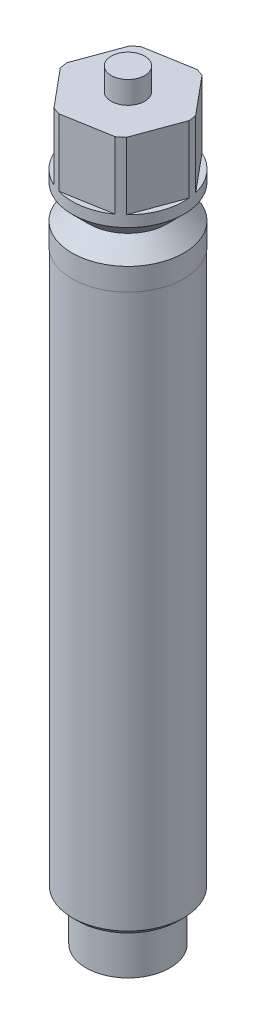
ISO-10303-21;
HEADER;
FILE_DESCRIPTION(('STEP AP214'),'2;1');
FILE_NAME('part.step','',(''),(''),'','','');
FILE_SCHEMA(('AUTOMOTIVE_DESIGN { 1 0 10303 214 1 1 1 1 }'));
ENDSEC;
DATA;
#1=APPLICATION_CONTEXT('core data for automotive mechanical design processes');
#2=APPLICATION_PROTOCOL_DEFINITION('international standard','automotive_design',2000,#1);
#3=PRODUCT_CONTEXT('',#1,'mechanical');
#4=PRODUCT('Part','Part','',(#3));
#5=PRODUCT_RELATED_PRODUCT_CATEGORY('part','',(#4));
#6=PRODUCT_DEFINITION_FORMATION('','',#4);
#7=PRODUCT_DEFINITION_CONTEXT('part definition',#1,'design');
#8=PRODUCT_DEFINITION('design','',#6,#7);
#9=PRODUCT_DEFINITION_SHAPE('','',#8);
#10=(LENGTH_UNIT() NAMED_UNIT(*) SI_UNIT(.MILLI.,.METRE.));
#11=(NAMED_UNIT(*) PLANE_ANGLE_UNIT() SI_UNIT($,.RADIAN.));
#12=(NAMED_UNIT(*) SI_UNIT($,.STERADIAN.) SOLID_ANGLE_UNIT());
#13=UNCERTAINTY_MEASURE_WITH_UNIT(LENGTH_MEASURE(1.E-05),#10,'distance_accuracy_value','');
#14=(GEOMETRIC_REPRESENTATION_CONTEXT(3) GLOBAL_UNCERTAINTY_ASSIGNED_CONTEXT((#13)) GLOBAL_UNIT_ASSIGNED_CONTEXT((#10,
#11,#12)) REPRESENTATION_CONTEXT('',''));
#15=CARTESIAN_POINT('',(0.,0.,0.));
#16=DIRECTION('',(0.,0.,1.));
#17=DIRECTION('',(1.,0.,0.));
#18=AXIS2_PLACEMENT_3D('',#15,#16,#17);
#19=CARTESIAN_POINT('',(0.,-50.,0.));
#20=DIRECTION('',(0.,-1.,0.));
#21=DIRECTION('',(0.,0.,-1.));
#22=AXIS2_PLACEMENT_3D('',#19,#20,#21);
#23=PLANE('',#22);
#24=CARTESIAN_POINT('',(0.,-50.,0.));
#25=DIRECTION('',(0.,-1.,0.));
#26=DIRECTION('',(0.,0.,-1.));
#27=AXIS2_PLACEMENT_3D('',#24,#25,#26);
#28=CIRCLE('',#27,4.48);
#29=CARTESIAN_POINT('',(0.,-50.,-4.48));
#30=VERTEX_POINT('',#29);
#31=EDGE_CURVE('E356',#30,#30,#28,.T.);
#32=ORIENTED_EDGE('',*,*,#31,.T.);
#33=EDGE_LOOP('',(#32));
#34=FACE_BOUND('',#33,.T.);
#35=CARTESIAN_POINT('',(0.,-50.,0.));
#36=DIRECTION('',(0.,-1.,0.));
#37=DIRECTION('',(0.,0.,-1.));
#38=AXIS2_PLACEMENT_3D('',#35,#36,#37);
#39=CIRCLE('',#38,3.75);
#40=CARTESIAN_POINT('',(0.,-50.,-3.75));
#41=VERTEX_POINT('',#40);
#42=EDGE_CURVE('E626',#41,#41,#39,.T.);
#43=ORIENTED_EDGE('',*,*,#42,.F.);
#44=EDGE_LOOP('',(#43));
#45=FACE_BOUND('',#44,.T.);
#46=ADVANCED_FACE('F348',(#34,#45),#23,.T.);
#47=CARTESIAN_POINT('',(0.,0.,0.));
#48=DIRECTION('',(0.,1.,0.));
#49=DIRECTION('',(0.,0.,1.));
#50=AXIS2_PLACEMENT_3D('',#47,#48,#49);
#51=PLANE('',#50);
#52=CARTESIAN_POINT('',(0.,0.,0.));
#53=DIRECTION('',(0.,1.,0.));
#54=DIRECTION('',(0.,0.,1.));
#55=AXIS2_PLACEMENT_3D('',#52,#53,#54);
#56=CIRCLE('',#55,5.);
#57=CARTESIAN_POINT('',(0.,0.,5.));
#58=VERTEX_POINT('',#57);
#59=EDGE_CURVE('E472',#58,#58,#56,.T.);
#60=ORIENTED_EDGE('',*,*,#59,.F.);
#61=EDGE_LOOP('',(#60));
#62=FACE_BOUND('',#61,.T.);
#63=CARTESIAN_POINT('',(0.,0.,0.));
#64=DIRECTION('',(0.,1.,0.));
#65=DIRECTION('',(0.,0.,1.));
#66=AXIS2_PLACEMENT_3D('',#63,#64,#65);
#67=CIRCLE('',#66,4.98);
#68=CARTESIAN_POINT('',(0.,0.,4.98));
#69=VERTEX_POINT('',#68);
#70=EDGE_CURVE('E500',#69,#69,#67,.F.);
#71=ORIENTED_EDGE('',*,*,#70,.F.);
#72=EDGE_LOOP('',(#71));
#73=FACE_BOUND('',#72,.T.);
#74=ADVANCED_FACE('F521',(#62,#73),#51,.F.);
#75=CARTESIAN_POINT('',(0.,12.,0.));
#76=DIRECTION('',(0.,1.,0.));
#77=DIRECTION('',(0.,0.,1.));
#78=AXIS2_PLACEMENT_3D('',#75,#76,#77);
#79=PLANE('',#78);
#80=CARTESIAN_POINT('',(0.,12.,0.));
#81=DIRECTION('',(0.,1.,0.));
#82=DIRECTION('',(0.,0.,1.));
#83=AXIS2_PLACEMENT_3D('',#80,#81,#82);
#84=CIRCLE('',#83,1.5);
#85=CARTESIAN_POINT('',(0.,12.,1.5));
#86=VERTEX_POINT('',#85);
#87=EDGE_CURVE('E586',#86,#86,#84,.T.);
#88=ORIENTED_EDGE('',*,*,#87,.F.);
#89=EDGE_LOOP('',(#88));
#90=FACE_BOUND('',#89,.T.);
#91=CARTESIAN_POINT('',(0.,12.,0.));
#92=DIRECTION('',(0.,1.,0.));
#93=DIRECTION('',(0.,0.,1.));
#94=AXIS2_PLACEMENT_3D('',#91,#92,#93);
#95=CIRCLE('',#94,5.);
#96=CARTESIAN_POINT('',(2.06183256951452,12.,-4.5550901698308));
#97=VERTEX_POINT('',#96);
#98=CARTESIAN_POINT('',(1.38132784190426,12.,-4.80540668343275));
#99=VERTEX_POINT('',#98);
#100=EDGE_CURVE('E463',#97,#99,#95,.T.);
#101=ORIENTED_EDGE('',*,*,#100,.T.);
#102=DIRECTION('',(-0.985394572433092,0.,0.170286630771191));
#103=VECTOR('',#102,1.);
#104=CARTESIAN_POINT('',(1.79384035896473,12.,-4.87669322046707));
#105=LINE('',#104,#103);
#106=CARTESIAN_POINT('',(-2.91390751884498,12.,-4.06314446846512));
#107=VERTEX_POINT('',#106);
#108=EDGE_CURVE('E448',#99,#107,#105,.T.);
#109=ORIENTED_EDGE('',*,*,#108,.T.);
#110=CARTESIAN_POINT('',(-3.47094034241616,12.,-3.5989683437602));
#111=VERTEX_POINT('',#110);
#112=EDGE_CURVE('E455',#107,#111,#95,.T.);
#113=ORIENTED_EDGE('',*,*,#112,.T.);
#114=DIRECTION('',(-0.345224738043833,0.,0.938520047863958));
#115=VECTOR('',#114,1.);
#116=CARTESIAN_POINT('',(-3.32642003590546,12.,-3.99185793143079));
#117=LINE('',#116,#115);
#118=CARTESIAN_POINT('',(-4.9757400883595,12.,0.491945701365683));
#119=VERTEX_POINT('',#118);
#120=EDGE_CURVE('E436',#111,#119,#117,.T.);
#121=ORIENTED_EDGE('',*,*,#120,.T.);
#122=CARTESIAN_POINT('',(-4.85226818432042,12.,1.20643833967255));
#123=VERTEX_POINT('',#122);
#124=EDGE_CURVE('E464',#119,#123,#95,.T.);
#125=ORIENTED_EDGE('',*,*,#124,.T.);
#126=DIRECTION('',(0.640169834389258,0.,0.768233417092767));
#127=VECTOR('',#126,1.);
#128=CARTESIAN_POINT('',(-5.1202603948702,12.,0.884835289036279));
#129=LINE('',#128,#127);
#130=CARTESIAN_POINT('',(-2.06183256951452,12.,4.5550901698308));
#131=VERTEX_POINT('',#130);
#132=EDGE_CURVE('E447',#123,#131,#129,.T.);
#133=ORIENTED_EDGE('',*,*,#132,.T.);
#134=CARTESIAN_POINT('',(-1.38132784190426,12.,4.80540668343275));
#135=VERTEX_POINT('',#134);
#136=EDGE_CURVE('E467',#131,#135,#95,.T.);
#137=ORIENTED_EDGE('',*,*,#136,.T.);
#138=DIRECTION('',(0.985394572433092,0.,-0.170286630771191));
#139=VECTOR('',#138,1.);
#140=CARTESIAN_POINT('',(-1.79384035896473,12.,4.87669322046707));
#141=LINE('',#140,#139);
#142=CARTESIAN_POINT('',(2.91390751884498,12.,4.06314446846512));
#143=VERTEX_POINT('',#142);
#144=EDGE_CURVE('E608',#135,#143,#141,.T.);
#145=ORIENTED_EDGE('',*,*,#144,.T.);
#146=CARTESIAN_POINT('',(3.47094034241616,12.,3.5989683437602));
#147=VERTEX_POINT('',#146);
#148=EDGE_CURVE('E468',#143,#147,#95,.T.);
#149=ORIENTED_EDGE('',*,*,#148,.T.);
#150=DIRECTION('',(0.345224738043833,0.,-0.938520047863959));
#151=VECTOR('',#150,1.);
#152=CARTESIAN_POINT('',(3.32642003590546,12.,3.99185793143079));
#153=LINE('',#152,#151);
#154=CARTESIAN_POINT('',(4.9757400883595,12.,-0.491945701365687));
#155=VERTEX_POINT('',#154);
#156=EDGE_CURVE('E605',#147,#155,#153,.T.);
#157=ORIENTED_EDGE('',*,*,#156,.T.);
#158=CARTESIAN_POINT('',(4.85226818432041,12.,-1.20643833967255));
#159=VERTEX_POINT('',#158);
#160=EDGE_CURVE('E466',#155,#159,#95,.T.);
#161=ORIENTED_EDGE('',*,*,#160,.T.);
#162=DIRECTION('',(-0.640169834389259,0.,-0.768233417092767));
#163=VECTOR('',#162,1.);
#164=CARTESIAN_POINT('',(5.1202603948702,12.,-0.88483528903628));
#165=LINE('',#164,#163);
#166=EDGE_CURVE('E602',#159,#97,#165,.T.);
#167=ORIENTED_EDGE('',*,*,#166,.T.);
#168=EDGE_LOOP('',(#101,#109,#113,#121,#125,#133,#137,#145,#149,#157,#161,#167));
#169=FACE_BOUND('',#168,.T.);
#170=ADVANCED_FACE('F462',(#90,#169),#79,.T.);
#171=CARTESIAN_POINT('',(0.,12.,0.));
#172=DIRECTION('',(0.,-1.,0.));
#173=DIRECTION('',(0.,0.,-1.));
#174=AXIS2_PLACEMENT_3D('',#171,#172,#173);
#175=CYLINDRICAL_SURFACE('',#174,5.);
#176=CARTESIAN_POINT('',(0.,5.,0.));
#177=DIRECTION('',(0.,1.,0.));
#178=DIRECTION('',(0.,0.,1.));
#179=AXIS2_PLACEMENT_3D('',#176,#177,#178);
#180=CIRCLE('',#179,5.);
#181=CARTESIAN_POINT('',(0.,5.,5.));
#182=VERTEX_POINT('',#181);
#183=EDGE_CURVE('E617',#182,#182,#180,.T.);
#184=ORIENTED_EDGE('',*,*,#183,.T.);
#185=EDGE_LOOP('',(#184));
#186=FACE_BOUND('',#185,.T.);
#187=DIRECTION('',(0.,-1.,0.));
#188=VECTOR('',#187,1.);
#189=CARTESIAN_POINT('',(1.38132784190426,12.,-4.80540668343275));
#190=LINE('',#189,#188);
#191=CARTESIAN_POINT('',(1.38132784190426,6.,-4.80540668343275));
#192=VERTEX_POINT('',#191);
#193=EDGE_CURVE('E498',#99,#192,#190,.T.);
#194=ORIENTED_EDGE('',*,*,#193,.F.);
#195=ORIENTED_EDGE('',*,*,#100,.F.);
#196=DIRECTION('',(0.,-1.,0.));
#197=VECTOR('',#196,1.);
#198=CARTESIAN_POINT('',(2.06183256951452,12.,-4.5550901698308));
#199=LINE('',#198,#197);
#200=CARTESIAN_POINT('',(2.06183256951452,6.,-4.5550901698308));
#201=VERTEX_POINT('',#200);
#202=EDGE_CURVE('E491',#201,#97,#199,.F.);
#203=ORIENTED_EDGE('',*,*,#202,.F.);
#204=CARTESIAN_POINT('',(0.,6.,0.));
#205=DIRECTION('',(0.,1.,0.));
#206=DIRECTION('',(0.,0.,1.));
#207=AXIS2_PLACEMENT_3D('',#204,#205,#206);
#208=CIRCLE('',#207,5.);
#209=CARTESIAN_POINT('',(4.85226818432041,6.,-1.20643833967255));
#210=VERTEX_POINT('',#209);
#211=EDGE_CURVE('E493',#210,#201,#208,.T.);
#212=ORIENTED_EDGE('',*,*,#211,.F.);
#213=DIRECTION('',(0.,-1.,0.));
#214=VECTOR('',#213,1.);
#215=CARTESIAN_POINT('',(4.85226818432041,12.,-1.20643833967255));
#216=LINE('',#215,#214);
#217=EDGE_CURVE('E494',#159,#210,#216,.T.);
#218=ORIENTED_EDGE('',*,*,#217,.F.);
#219=ORIENTED_EDGE('',*,*,#160,.F.);
#220=DIRECTION('',(0.,-1.,0.));
#221=VECTOR('',#220,1.);
#222=CARTESIAN_POINT('',(4.9757400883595,12.,-0.491945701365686));
#223=LINE('',#222,#221);
#224=CARTESIAN_POINT('',(4.9757400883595,6.,-0.491945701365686));
#225=VERTEX_POINT('',#224);
#226=EDGE_CURVE('E486',#225,#155,#223,.F.);
#227=ORIENTED_EDGE('',*,*,#226,.F.);
#228=CARTESIAN_POINT('',(3.47094034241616,6.,3.5989683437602));
#229=VERTEX_POINT('',#228);
#230=EDGE_CURVE('E488',#229,#225,#208,.T.);
#231=ORIENTED_EDGE('',*,*,#230,.F.);
#232=DIRECTION('',(0.,-1.,0.));
#233=VECTOR('',#232,1.);
#234=CARTESIAN_POINT('',(3.47094034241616,12.,3.5989683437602));
#235=LINE('',#234,#233);
#236=EDGE_CURVE('E489',#147,#229,#235,.T.);
#237=ORIENTED_EDGE('',*,*,#236,.F.);
#238=ORIENTED_EDGE('',*,*,#148,.F.);
#239=DIRECTION('',(0.,-1.,0.));
#240=VECTOR('',#239,1.);
#241=CARTESIAN_POINT('',(2.91390751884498,12.,4.06314446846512));
#242=LINE('',#241,#240);
#243=CARTESIAN_POINT('',(2.91390751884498,6.,4.06314446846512));
#244=VERTEX_POINT('',#243);
#245=EDGE_CURVE('E481',#244,#143,#242,.F.);
#246=ORIENTED_EDGE('',*,*,#245,.F.);
#247=CARTESIAN_POINT('',(-1.38132784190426,6.,4.80540668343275));
#248=VERTEX_POINT('',#247);
#249=EDGE_CURVE('E483',#248,#244,#208,.T.);
#250=ORIENTED_EDGE('',*,*,#249,.F.);
#251=DIRECTION('',(0.,-1.,0.));
#252=VECTOR('',#251,1.);
#253=CARTESIAN_POINT('',(-1.38132784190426,12.,4.80540668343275));
#254=LINE('',#253,#252);
#255=EDGE_CURVE('E484',#135,#248,#254,.T.);
#256=ORIENTED_EDGE('',*,*,#255,.F.);
#257=ORIENTED_EDGE('',*,*,#136,.F.);
#258=DIRECTION('',(0.,-1.,0.));
#259=VECTOR('',#258,1.);
#260=CARTESIAN_POINT('',(-2.06183256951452,12.,4.5550901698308));
#261=LINE('',#260,#259);
#262=CARTESIAN_POINT('',(-2.06183256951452,6.,4.5550901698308));
#263=VERTEX_POINT('',#262);
#264=EDGE_CURVE('E458',#263,#131,#261,.F.);
#265=ORIENTED_EDGE('',*,*,#264,.F.);
#266=CARTESIAN_POINT('',(-4.85226818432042,6.,1.20643833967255));
#267=VERTEX_POINT('',#266);
#268=EDGE_CURVE('E476',#267,#263,#208,.T.);
#269=ORIENTED_EDGE('',*,*,#268,.F.);
#270=DIRECTION('',(0.,-1.,0.));
#271=VECTOR('',#270,1.);
#272=CARTESIAN_POINT('',(-4.85226818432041,12.,1.20643833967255));
#273=LINE('',#272,#271);
#274=EDGE_CURVE('E479',#123,#267,#273,.T.);
#275=ORIENTED_EDGE('',*,*,#274,.F.);
#276=ORIENTED_EDGE('',*,*,#124,.F.);
#277=DIRECTION('',(0.,-1.,0.));
#278=VECTOR('',#277,1.);
#279=CARTESIAN_POINT('',(-4.9757400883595,12.,0.491945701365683));
#280=LINE('',#279,#278);
#281=CARTESIAN_POINT('',(-4.9757400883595,6.,0.491945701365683));
#282=VERTEX_POINT('',#281);
#283=EDGE_CURVE('E442',#282,#119,#280,.F.);
#284=ORIENTED_EDGE('',*,*,#283,.F.);
#285=CARTESIAN_POINT('',(-3.47094034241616,6.,-3.5989683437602));
#286=VERTEX_POINT('',#285);
#287=EDGE_CURVE('E457',#286,#282,#208,.T.);
#288=ORIENTED_EDGE('',*,*,#287,.F.);
#289=DIRECTION('',(0.,-1.,0.));
#290=VECTOR('',#289,1.);
#291=CARTESIAN_POINT('',(-3.47094034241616,12.,-3.5989683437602));
#292=LINE('',#291,#290);
#293=EDGE_CURVE('E439',#111,#286,#292,.T.);
#294=ORIENTED_EDGE('',*,*,#293,.F.);
#295=ORIENTED_EDGE('',*,*,#112,.F.);
#296=DIRECTION('',(0.,-1.,0.));
#297=VECTOR('',#296,1.);
#298=CARTESIAN_POINT('',(-2.91390751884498,12.,-4.06314446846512));
#299=LINE('',#298,#297);
#300=CARTESIAN_POINT('',(-2.91390751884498,6.,-4.06314446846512));
#301=VERTEX_POINT('',#300);
#302=EDGE_CURVE('E496',#301,#107,#299,.F.);
#303=ORIENTED_EDGE('',*,*,#302,.F.);
#304=EDGE_CURVE('E475',#192,#301,#208,.T.);
#305=ORIENTED_EDGE('',*,*,#304,.F.);
#306=EDGE_LOOP('',(#194,#195,#203,#212,#218,#219,#227,#231,#237,#238,#246,#250,#256,#257,#265,
#269,#275,#276,#284,#288,#294,#295,#303,#305));
#307=FACE_BOUND('',#306,.T.);
#308=ADVANCED_FACE('F350',(#186,#307),#175,.T.);
#309=CARTESIAN_POINT('',(0.,14.,0.));
#310=DIRECTION('',(0.,-1.,0.));
#311=DIRECTION('',(0.,0.,-1.));
#312=AXIS2_PLACEMENT_3D('',#309,#310,#311);
#313=CYLINDRICAL_SURFACE('',#312,1.5);
#314=CARTESIAN_POINT('',(0.,14.,0.));
#315=DIRECTION('',(0.,1.,0.));
#316=DIRECTION('',(0.,0.,1.));
#317=AXIS2_PLACEMENT_3D('',#314,#315,#316);
#318=CIRCLE('',#317,1.5);
#319=CARTESIAN_POINT('',(0.,14.,1.5));
#320=VERTEX_POINT('',#319);
#321=EDGE_CURVE('E588',#320,#320,#318,.T.);
#322=ORIENTED_EDGE('',*,*,#321,.F.);
#323=EDGE_LOOP('',(#322));
#324=FACE_BOUND('',#323,.T.);
#325=ORIENTED_EDGE('',*,*,#87,.T.);
#326=EDGE_LOOP('',(#325));
#327=FACE_BOUND('',#326,.T.);
#328=ADVANCED_FACE('F574',(#324,#327),#313,.T.);
#329=CARTESIAN_POINT('',(0.,14.,0.));
#330=DIRECTION('',(0.,1.,0.));
#331=DIRECTION('',(0.,0.,1.));
#332=AXIS2_PLACEMENT_3D('',#329,#330,#331);
#333=PLANE('',#332);
#334=ORIENTED_EDGE('',*,*,#321,.T.);
#335=EDGE_LOOP('',(#334));
#336=FACE_BOUND('',#335,.T.);
#337=ADVANCED_FACE('F565',(#336),#333,.T.);
#338=CARTESIAN_POINT('',(-3.32642003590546,6.,-3.99185793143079));
#339=DIRECTION('',(-0.938520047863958,0.,-0.345224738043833));
#340=DIRECTION('',(-0.345224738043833,0.,0.938520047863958));
#341=AXIS2_PLACEMENT_3D('',#338,#339,#340);
#342=PLANE('',#341);
#343=ORIENTED_EDGE('',*,*,#293,.T.);
#344=DIRECTION('',(-0.345224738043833,0.,0.938520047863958));
#345=VECTOR('',#344,1.);
#346=CARTESIAN_POINT('',(-3.32642003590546,6.,-3.99185793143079));
#347=LINE('',#346,#345);
#348=EDGE_CURVE('E599',#286,#282,#347,.T.);
#349=ORIENTED_EDGE('',*,*,#348,.T.);
#350=ORIENTED_EDGE('',*,*,#283,.T.);
#351=ORIENTED_EDGE('',*,*,#120,.F.);
#352=EDGE_LOOP('',(#343,#349,#350,#351));
#353=FACE_BOUND('',#352,.T.);
#354=ADVANCED_FACE('F438',(#353),#342,.T.);
#355=CARTESIAN_POINT('',(0.,6.,0.));
#356=DIRECTION('',(0.,1.,0.));
#357=DIRECTION('',(0.,0.,1.));
#358=AXIS2_PLACEMENT_3D('',#355,#356,#357);
#359=PLANE('',#358);
#360=ORIENTED_EDGE('',*,*,#287,.T.);
#361=ORIENTED_EDGE('',*,*,#348,.F.);
#362=EDGE_LOOP('',(#360,#361));
#363=FACE_BOUND('',#362,.T.);
#364=ADVANCED_FACE('F561',(#363),#359,.T.);
#365=CARTESIAN_POINT('',(-5.1202603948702,6.,0.884835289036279));
#366=DIRECTION('',(-0.768233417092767,0.,0.640169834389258));
#367=DIRECTION('',(0.640169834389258,0.,0.768233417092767));
#368=AXIS2_PLACEMENT_3D('',#365,#366,#367);
#369=PLANE('',#368);
#370=ORIENTED_EDGE('',*,*,#274,.T.);
#371=DIRECTION('',(0.640169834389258,0.,0.768233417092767));
#372=VECTOR('',#371,1.);
#373=CARTESIAN_POINT('',(-5.1202603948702,6.,0.884835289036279));
#374=LINE('',#373,#372);
#375=EDGE_CURVE('E597',#267,#263,#374,.T.);
#376=ORIENTED_EDGE('',*,*,#375,.T.);
#377=ORIENTED_EDGE('',*,*,#264,.T.);
#378=ORIENTED_EDGE('',*,*,#132,.F.);
#379=EDGE_LOOP('',(#370,#376,#377,#378));
#380=FACE_BOUND('',#379,.T.);
#381=ADVANCED_FACE('F558',(#380),#369,.T.);
#382=ORIENTED_EDGE('',*,*,#268,.T.);
#383=ORIENTED_EDGE('',*,*,#375,.F.);
#384=EDGE_LOOP('',(#382,#383));
#385=FACE_BOUND('',#384,.T.);
#386=ADVANCED_FACE('F556',(#385),#359,.T.);
#387=CARTESIAN_POINT('',(-1.79384035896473,6.,4.87669322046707));
#388=DIRECTION('',(0.170286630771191,0.,0.985394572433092));
#389=DIRECTION('',(0.985394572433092,0.,-0.170286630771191));
#390=AXIS2_PLACEMENT_3D('',#387,#388,#389);
#391=PLANE('',#390);
#392=ORIENTED_EDGE('',*,*,#255,.T.);
#393=DIRECTION('',(0.985394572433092,0.,-0.170286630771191));
#394=VECTOR('',#393,1.);
#395=CARTESIAN_POINT('',(-1.79384035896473,6.,4.87669322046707));
#396=LINE('',#395,#394);
#397=EDGE_CURVE('E595',#248,#244,#396,.T.);
#398=ORIENTED_EDGE('',*,*,#397,.T.);
#399=ORIENTED_EDGE('',*,*,#245,.T.);
#400=ORIENTED_EDGE('',*,*,#144,.F.);
#401=EDGE_LOOP('',(#392,#398,#399,#400));
#402=FACE_BOUND('',#401,.T.);
#403=ADVANCED_FACE('F553',(#402),#391,.T.);
#404=ORIENTED_EDGE('',*,*,#249,.T.);
#405=ORIENTED_EDGE('',*,*,#397,.F.);
#406=EDGE_LOOP('',(#404,#405));
#407=FACE_BOUND('',#406,.T.);
#408=ADVANCED_FACE('F551',(#407),#359,.T.);
#409=CARTESIAN_POINT('',(3.32642003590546,6.,3.99185793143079));
#410=DIRECTION('',(0.938520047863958,0.,0.345224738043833));
#411=DIRECTION('',(0.345224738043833,0.,-0.938520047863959));
#412=AXIS2_PLACEMENT_3D('',#409,#410,#411);
#413=PLANE('',#412);
#414=ORIENTED_EDGE('',*,*,#236,.T.);
#415=DIRECTION('',(0.345224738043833,0.,-0.938520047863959));
#416=VECTOR('',#415,1.);
#417=CARTESIAN_POINT('',(3.32642003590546,6.,3.99185793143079));
#418=LINE('',#417,#416);
#419=EDGE_CURVE('E591',#229,#225,#418,.T.);
#420=ORIENTED_EDGE('',*,*,#419,.T.);
#421=ORIENTED_EDGE('',*,*,#226,.T.);
#422=ORIENTED_EDGE('',*,*,#156,.F.);
#423=EDGE_LOOP('',(#414,#420,#421,#422));
#424=FACE_BOUND('',#423,.T.);
#425=ADVANCED_FACE('F548',(#424),#413,.T.);
#426=ORIENTED_EDGE('',*,*,#230,.T.);
#427=ORIENTED_EDGE('',*,*,#419,.F.);
#428=EDGE_LOOP('',(#426,#427));
#429=FACE_BOUND('',#428,.T.);
#430=ADVANCED_FACE('F547',(#429),#359,.T.);
#431=CARTESIAN_POINT('',(5.1202603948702,6.,-0.88483528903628));
#432=DIRECTION('',(0.768233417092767,0.,-0.640169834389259));
#433=DIRECTION('',(-0.640169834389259,0.,-0.768233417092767));
#434=AXIS2_PLACEMENT_3D('',#431,#432,#433);
#435=PLANE('',#434);
#436=ORIENTED_EDGE('',*,*,#217,.T.);
#437=DIRECTION('',(-0.640169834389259,0.,-0.768233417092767));
#438=VECTOR('',#437,1.);
#439=CARTESIAN_POINT('',(5.1202603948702,6.,-0.88483528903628));
#440=LINE('',#439,#438);
#441=EDGE_CURVE('E371',#210,#201,#440,.T.);
#442=ORIENTED_EDGE('',*,*,#441,.T.);
#443=ORIENTED_EDGE('',*,*,#202,.T.);
#444=ORIENTED_EDGE('',*,*,#166,.F.);
#445=EDGE_LOOP('',(#436,#442,#443,#444));
#446=FACE_BOUND('',#445,.T.);
#447=ADVANCED_FACE('F543',(#446),#435,.T.);
#448=ORIENTED_EDGE('',*,*,#211,.T.);
#449=ORIENTED_EDGE('',*,*,#441,.F.);
#450=EDGE_LOOP('',(#448,#449));
#451=FACE_BOUND('',#450,.T.);
#452=ADVANCED_FACE('F546',(#451),#359,.T.);
#453=ORIENTED_EDGE('',*,*,#304,.T.);
#454=DIRECTION('',(-0.985394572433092,0.,0.170286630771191));
#455=VECTOR('',#454,1.);
#456=CARTESIAN_POINT('',(1.79384035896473,6.,-4.87669322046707));
#457=LINE('',#456,#455);
#458=EDGE_CURVE('E363',#192,#301,#457,.T.);
#459=ORIENTED_EDGE('',*,*,#458,.F.);
#460=EDGE_LOOP('',(#453,#459));
#461=FACE_BOUND('',#460,.T.);
#462=ADVANCED_FACE('F568',(#461),#359,.T.);
#463=CARTESIAN_POINT('',(1.79384035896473,6.,-4.87669322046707));
#464=DIRECTION('',(-0.170286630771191,0.,-0.985394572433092));
#465=DIRECTION('',(-0.985394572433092,0.,0.170286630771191));
#466=AXIS2_PLACEMENT_3D('',#463,#464,#465);
#467=PLANE('',#466);
#468=ORIENTED_EDGE('',*,*,#193,.T.);
#469=ORIENTED_EDGE('',*,*,#458,.T.);
#470=ORIENTED_EDGE('',*,*,#302,.T.);
#471=ORIENTED_EDGE('',*,*,#108,.F.);
#472=EDGE_LOOP('',(#468,#469,#470,#471));
#473=FACE_BOUND('',#472,.T.);
#474=ADVANCED_FACE('F541',(#473),#467,.T.);
#475=CARTESIAN_POINT('',(0.,2.,0.));
#476=DIRECTION('',(0.,-1.,0.));
#477=DIRECTION('',(0.,0.,-1.));
#478=AXIS2_PLACEMENT_3D('',#475,#476,#477);
#479=CONICAL_SURFACE('',#478,5.,0.785398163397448);
#480=CARTESIAN_POINT('',(0.,3.5,0.));
#481=DIRECTION('',(0.,1.,0.));
#482=DIRECTION('',(0.,0.,1.));
#483=AXIS2_PLACEMENT_3D('',#480,#481,#482);
#484=CIRCLE('',#483,3.5);
#485=CARTESIAN_POINT('',(0.,3.5,3.5));
#486=VERTEX_POINT('',#485);
#487=EDGE_CURVE('E620',#486,#486,#484,.T.);
#488=ORIENTED_EDGE('',*,*,#487,.F.);
#489=EDGE_LOOP('',(#488));
#490=FACE_BOUND('',#489,.T.);
#491=CARTESIAN_POINT('',(0.,2.,0.));
#492=DIRECTION('',(0.,1.,0.));
#493=DIRECTION('',(0.,0.,1.));
#494=AXIS2_PLACEMENT_3D('',#491,#492,#493);
#495=CIRCLE('',#494,5.);
#496=CARTESIAN_POINT('',(0.,2.,5.));
#497=VERTEX_POINT('',#496);
#498=EDGE_CURVE('E614',#497,#497,#495,.T.);
#499=ORIENTED_EDGE('',*,*,#498,.T.);
#500=EDGE_LOOP('',(#499));
#501=FACE_BOUND('',#500,.T.);
#502=ADVANCED_FACE('F537',(#490,#501),#479,.T.);
#503=CARTESIAN_POINT('',(0.,3.5,0.));
#504=DIRECTION('',(0.,1.,0.));
#505=DIRECTION('',(0.,0.,1.));
#506=AXIS2_PLACEMENT_3D('',#503,#504,#505);
#507=CONICAL_SURFACE('',#506,3.5,0.785398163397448);
#508=ORIENTED_EDGE('',*,*,#183,.F.);
#509=EDGE_LOOP('',(#508));
#510=FACE_BOUND('',#509,.T.);
#511=ORIENTED_EDGE('',*,*,#487,.T.);
#512=EDGE_LOOP('',(#511));
#513=FACE_BOUND('',#512,.T.);
#514=ADVANCED_FACE('F534',(#510,#513),#507,.T.);
#515=ORIENTED_EDGE('',*,*,#498,.F.);
#516=EDGE_LOOP('',(#515));
#517=FACE_BOUND('',#516,.T.);
#518=ORIENTED_EDGE('',*,*,#59,.T.);
#519=EDGE_LOOP('',(#518));
#520=FACE_BOUND('',#519,.T.);
#521=ADVANCED_FACE('F532',(#517,#520),#175,.T.);
#522=CARTESIAN_POINT('',(0.,-50.,0.));
#523=DIRECTION('',(0.,1.,0.));
#524=DIRECTION('',(0.,0.,1.));
#525=AXIS2_PLACEMENT_3D('',#522,#523,#524);
#526=CYLINDRICAL_SURFACE('',#525,4.98);
#527=CARTESIAN_POINT('',(0.,-49.5,0.));
#528=DIRECTION('',(0.,-1.,0.));
#529=DIRECTION('',(0.,0.,-1.));
#530=AXIS2_PLACEMENT_3D('',#527,#528,#529);
#531=CIRCLE('',#530,4.98);
#532=CARTESIAN_POINT('',(0.,-49.5,-4.98));
#533=VERTEX_POINT('',#532);
#534=EDGE_CURVE('E11',#533,#533,#531,.F.);
#535=ORIENTED_EDGE('',*,*,#534,.T.);
#536=EDGE_LOOP('',(#535));
#537=FACE_BOUND('',#536,.T.);
#538=ORIENTED_EDGE('',*,*,#70,.T.);
#539=EDGE_LOOP('',(#538));
#540=FACE_BOUND('',#539,.T.);
#541=ADVANCED_FACE('F530',(#537,#540),#526,.T.);
#542=CARTESIAN_POINT('',(0.,-54.,0.));
#543=DIRECTION('',(0.,1.,0.));
#544=DIRECTION('',(0.,0.,1.));
#545=AXIS2_PLACEMENT_3D('',#542,#543,#544);
#546=CYLINDRICAL_SURFACE('',#545,3.75);
#547=CARTESIAN_POINT('',(0.,-54.,0.));
#548=DIRECTION('',(0.,-1.,0.));
#549=DIRECTION('',(0.,0.,-1.));
#550=AXIS2_PLACEMENT_3D('',#547,#548,#549);
#551=CIRCLE('',#550,3.75);
#552=CARTESIAN_POINT('',(0.,-54.,-3.75));
#553=VERTEX_POINT('',#552);
#554=EDGE_CURVE('E623',#553,#553,#551,.T.);
#555=ORIENTED_EDGE('',*,*,#554,.F.);
#556=EDGE_LOOP('',(#555));
#557=FACE_BOUND('',#556,.T.);
#558=ORIENTED_EDGE('',*,*,#42,.T.);
#559=EDGE_LOOP('',(#558));
#560=FACE_BOUND('',#559,.T.);
#561=ADVANCED_FACE('F516',(#557,#560),#546,.T.);
#562=CARTESIAN_POINT('',(0.,-54.,0.));
#563=DIRECTION('',(0.,-1.,0.));
#564=DIRECTION('',(0.,0.,-1.));
#565=AXIS2_PLACEMENT_3D('',#562,#563,#564);
#566=PLANE('',#565);
#567=ORIENTED_EDGE('',*,*,#554,.T.);
#568=EDGE_LOOP('',(#567));
#569=FACE_BOUND('',#568,.T.);
#570=ADVANCED_FACE('F509',(#569),#566,.T.);
#571=CARTESIAN_POINT('',(0.,-50.,0.));
#572=DIRECTION('',(0.,1.,0.));
#573=DIRECTION('',(0.,0.,1.));
#574=AXIS2_PLACEMENT_3D('',#571,#572,#573);
#575=CONICAL_SURFACE('',#574,4.48,0.785398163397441);
#576=ORIENTED_EDGE('',*,*,#534,.F.);
#577=EDGE_LOOP('',(#576));
#578=FACE_BOUND('',#577,.T.);
#579=ORIENTED_EDGE('',*,*,#31,.F.);
#580=EDGE_LOOP('',(#579));
#581=FACE_BOUND('',#580,.T.);
#582=ADVANCED_FACE('F507',(#578,#581),#575,.T.);
#583=CLOSED_SHELL('',(#46,#74,#170,#308,#328,#337,#354,#364,#381,#386,#403,#408,#425,#430,#447,
#452,#462,#474,#502,#514,#521,#541,#561,#570,#582));
#584=MANIFOLD_SOLID_BREP('B2',#583);
#585=ADVANCED_BREP_SHAPE_REPRESENTATION('',(#18,#584),#14);
#586=SHAPE_DEFINITION_REPRESENTATION(#9,#585);
ENDSEC;
END-ISO-10303-21;
